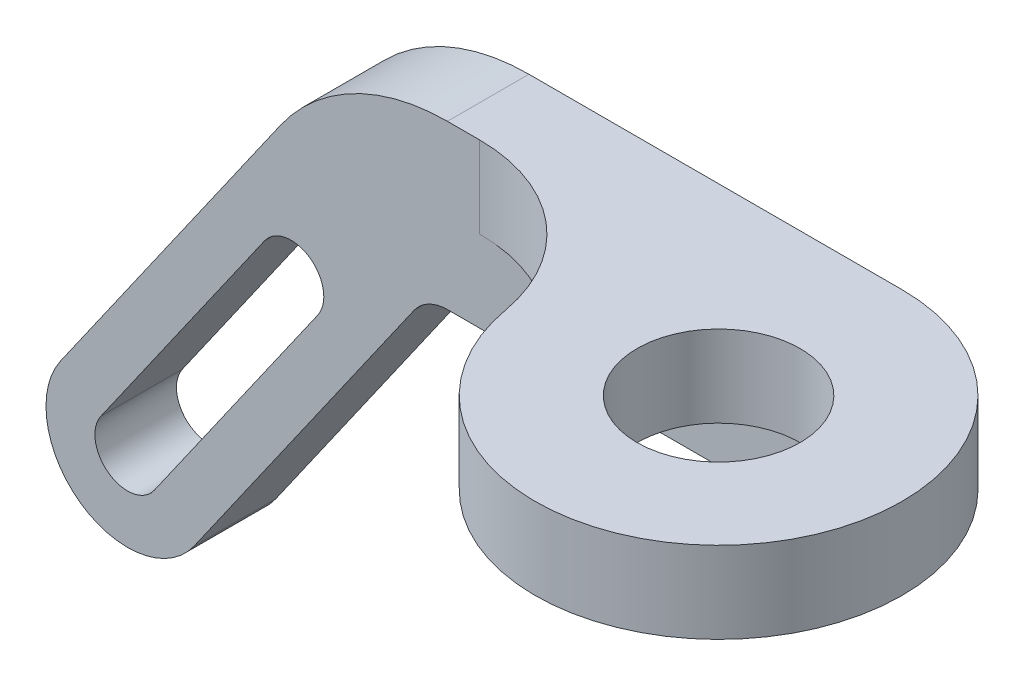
ISO-10303-21;
HEADER;
FILE_DESCRIPTION(('STEP AP214'),'2;1');
FILE_NAME('part.step','',(''),(''),'','','');
FILE_SCHEMA(('AUTOMOTIVE_DESIGN { 1 0 10303 214 1 1 1 1 }'));
ENDSEC;
DATA;
#1=APPLICATION_CONTEXT('core data for automotive mechanical design processes');
#2=APPLICATION_PROTOCOL_DEFINITION('international standard','automotive_design',2000,#1);
#3=PRODUCT_CONTEXT('',#1,'mechanical');
#4=PRODUCT('Part','Part','',(#3));
#5=PRODUCT_RELATED_PRODUCT_CATEGORY('part','',(#4));
#6=PRODUCT_DEFINITION_FORMATION('','',#4);
#7=PRODUCT_DEFINITION_CONTEXT('part definition',#1,'design');
#8=PRODUCT_DEFINITION('design','',#6,#7);
#9=PRODUCT_DEFINITION_SHAPE('','',#8);
#10=(LENGTH_UNIT() NAMED_UNIT(*) SI_UNIT(.MILLI.,.METRE.));
#11=(NAMED_UNIT(*) PLANE_ANGLE_UNIT() SI_UNIT($,.RADIAN.));
#12=(NAMED_UNIT(*) SI_UNIT($,.STERADIAN.) SOLID_ANGLE_UNIT());
#13=UNCERTAINTY_MEASURE_WITH_UNIT(LENGTH_MEASURE(1.E-05),#10,'distance_accuracy_value','');
#14=(GEOMETRIC_REPRESENTATION_CONTEXT(3) GLOBAL_UNCERTAINTY_ASSIGNED_CONTEXT((#13)) GLOBAL_UNIT_ASSIGNED_CONTEXT((#10,
#11,#12)) REPRESENTATION_CONTEXT('',''));
#15=CARTESIAN_POINT('',(0.,0.,0.));
#16=DIRECTION('',(0.,0.,1.));
#17=DIRECTION('',(1.,0.,0.));
#18=AXIS2_PLACEMENT_3D('',#15,#16,#17);
#19=CARTESIAN_POINT('',(45.7627579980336,25.,10.));
#20=DIRECTION('',(-1.,0.,0.));
#21=DIRECTION('',(0.,0.,1.));
#22=AXIS2_PLACEMENT_3D('',#19,#20,#21);
#23=PLANE('',#22);
#24=DIRECTION('',(0.,0.,-1.));
#25=VECTOR('',#24,1.);
#26=CARTESIAN_POINT('',(45.7627579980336,15.,10.));
#27=LINE('',#26,#25);
#28=CARTESIAN_POINT('',(45.7627579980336,15.,10.));
#29=VERTEX_POINT('',#28);
#30=CARTESIAN_POINT('',(45.7627579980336,15.,0.));
#31=VERTEX_POINT('',#30);
#32=EDGE_CURVE('E180',#29,#31,#27,.T.);
#33=ORIENTED_EDGE('',*,*,#32,.F.);
#34=DIRECTION('',(0.,1.,0.));
#35=VECTOR('',#34,1.);
#36=CARTESIAN_POINT('',(45.7627579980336,25.,10.));
#37=LINE('',#36,#35);
#38=CARTESIAN_POINT('',(45.7627579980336,5.,10.));
#39=VERTEX_POINT('',#38);
#40=EDGE_CURVE('E194',#39,#29,#37,.T.);
#41=ORIENTED_EDGE('',*,*,#40,.F.);
#42=DIRECTION('',(0.,0.,-1.));
#43=VECTOR('',#42,1.);
#44=CARTESIAN_POINT('',(45.7627579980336,5.,10.));
#45=LINE('',#44,#43);
#46=CARTESIAN_POINT('',(45.7627579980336,5.,0.));
#47=VERTEX_POINT('',#46);
#48=EDGE_CURVE('E229',#39,#47,#45,.T.);
#49=ORIENTED_EDGE('',*,*,#48,.T.);
#50=DIRECTION('',(0.,1.,0.));
#51=VECTOR('',#50,1.);
#52=CARTESIAN_POINT('',(45.7627579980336,25.,0.));
#53=LINE('',#52,#51);
#54=EDGE_CURVE('E213',#47,#31,#53,.T.);
#55=ORIENTED_EDGE('',*,*,#54,.T.);
#56=EDGE_LOOP('',(#33,#41,#49,#55));
#57=FACE_BOUND('',#56,.T.);
#58=ADVANCED_FACE('F32',(#57),#23,.F.);
#59=CARTESIAN_POINT('',(-39.2372420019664,-29.88488702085,10.));
#60=DIRECTION('',(0.,0.,-1.));
#61=DIRECTION('',(-1.,0.,0.));
#62=AXIS2_PLACEMENT_3D('',#59,#60,#61);
#63=CYLINDRICAL_SURFACE('',#62,10.);
#64=CARTESIAN_POINT('',(-39.2372420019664,-29.88488702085,0.));
#65=DIRECTION('',(0.,0.,1.));
#66=DIRECTION('',(1.,0.,0.));
#67=AXIS2_PLACEMENT_3D('',#64,#65,#66);
#68=CIRCLE('',#67,10.);
#69=CARTESIAN_POINT('',(-47.4287624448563,-24.1491226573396,0.));
#70=VERTEX_POINT('',#69);
#71=CARTESIAN_POINT('',(-31.0457215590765,-35.6206513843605,0.));
#72=VERTEX_POINT('',#71);
#73=EDGE_CURVE('E183',#70,#72,#68,.T.);
#74=ORIENTED_EDGE('',*,*,#73,.T.);
#75=DIRECTION('',(0.,0.,-1.));
#76=VECTOR('',#75,1.);
#77=CARTESIAN_POINT('',(-31.0457215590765,-35.6206513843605,10.));
#78=LINE('',#77,#76);
#79=CARTESIAN_POINT('',(-31.0457215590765,-35.6206513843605,10.));
#80=VERTEX_POINT('',#79);
#81=EDGE_CURVE('E238',#80,#72,#78,.T.);
#82=ORIENTED_EDGE('',*,*,#81,.F.);
#83=CARTESIAN_POINT('',(-39.2372420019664,-29.88488702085,10.));
#84=DIRECTION('',(0.,0.,1.));
#85=DIRECTION('',(1.,0.,0.));
#86=AXIS2_PLACEMENT_3D('',#83,#84,#85);
#87=CIRCLE('',#86,10.);
#88=CARTESIAN_POINT('',(-47.4287624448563,-24.1491226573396,10.));
#89=VERTEX_POINT('',#88);
#90=EDGE_CURVE('E184',#89,#80,#87,.T.);
#91=ORIENTED_EDGE('',*,*,#90,.F.);
#92=DIRECTION('',(0.,0.,-1.));
#93=VECTOR('',#92,1.);
#94=CARTESIAN_POINT('',(-47.4287624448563,-24.1491226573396,10.));
#95=LINE('',#94,#93);
#96=EDGE_CURVE('E203',#89,#70,#95,.T.);
#97=ORIENTED_EDGE('',*,*,#96,.T.);
#98=EDGE_LOOP('',(#74,#82,#91,#97));
#99=FACE_BOUND('',#98,.T.);
#100=ADVANCED_FACE('F277',(#99),#63,.T.);
#101=CARTESIAN_POINT('',(-31.0457215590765,-35.6206513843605,10.));
#102=DIRECTION('',(-0.819152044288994,0.573576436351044,0.));
#103=DIRECTION('',(-0.573576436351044,-0.819152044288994,0.));
#104=AXIS2_PLACEMENT_3D('',#101,#102,#103);
#105=PLANE('',#104);
#106=DIRECTION('',(0.573576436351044,0.819152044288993,0.));
#107=VECTOR('',#106,1.);
#108=CARTESIAN_POINT('',(-31.0457215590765,-35.6206513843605,0.));
#109=LINE('',#108,#107);
#110=CARTESIAN_POINT('',(-4.09576022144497,2.86788218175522,0.));
#111=VERTEX_POINT('',#110);
#112=EDGE_CURVE('E206',#72,#111,#109,.T.);
#113=ORIENTED_EDGE('',*,*,#112,.T.);
#114=DIRECTION('',(0.,0.,-1.));
#115=VECTOR('',#114,1.);
#116=CARTESIAN_POINT('',(-4.09576022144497,2.86788218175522,10.));
#117=LINE('',#116,#115);
#118=CARTESIAN_POINT('',(-4.09576022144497,2.86788218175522,10.));
#119=VERTEX_POINT('',#118);
#120=EDGE_CURVE('E235',#119,#111,#117,.T.);
#121=ORIENTED_EDGE('',*,*,#120,.F.);
#122=DIRECTION('',(0.573576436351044,0.819152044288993,0.));
#123=VECTOR('',#122,1.);
#124=CARTESIAN_POINT('',(-31.0457215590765,-35.6206513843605,10.));
#125=LINE('',#124,#123);
#126=EDGE_CURVE('E187',#80,#119,#125,.T.);
#127=ORIENTED_EDGE('',*,*,#126,.F.);
#128=ORIENTED_EDGE('',*,*,#81,.T.);
#129=EDGE_LOOP('',(#113,#121,#127,#128));
#130=FACE_BOUND('',#129,.T.);
#131=ADVANCED_FACE('F279',(#130),#105,.F.);
#132=CARTESIAN_POINT('',(0.,0.,10.));
#133=DIRECTION('',(0.,0.,-1.));
#134=DIRECTION('',(-1.,0.,0.));
#135=AXIS2_PLACEMENT_3D('',#132,#133,#134);
#136=CYLINDRICAL_SURFACE('',#135,5.);
#137=CARTESIAN_POINT('',(0.,0.,0.));
#138=DIRECTION('',(0.,0.,-1.));
#139=DIRECTION('',(-1.,0.,0.));
#140=AXIS2_PLACEMENT_3D('',#137,#138,#139);
#141=CIRCLE('',#140,5.);
#142=CARTESIAN_POINT('',(0.,5.,0.));
#143=VERTEX_POINT('',#142);
#144=EDGE_CURVE('E208',#111,#143,#141,.T.);
#145=ORIENTED_EDGE('',*,*,#144,.T.);
#146=DIRECTION('',(0.,0.,-1.));
#147=VECTOR('',#146,1.);
#148=CARTESIAN_POINT('',(0.,5.,10.));
#149=LINE('',#148,#147);
#150=CARTESIAN_POINT('',(0.,5.,10.));
#151=VERTEX_POINT('',#150);
#152=EDGE_CURVE('E232',#151,#143,#149,.T.);
#153=ORIENTED_EDGE('',*,*,#152,.F.);
#154=CARTESIAN_POINT('',(0.,0.,10.));
#155=DIRECTION('',(0.,0.,-1.));
#156=DIRECTION('',(-1.,0.,0.));
#157=AXIS2_PLACEMENT_3D('',#154,#155,#156);
#158=CIRCLE('',#157,5.);
#159=EDGE_CURVE('E190',#119,#151,#158,.T.);
#160=ORIENTED_EDGE('',*,*,#159,.F.);
#161=ORIENTED_EDGE('',*,*,#120,.T.);
#162=EDGE_LOOP('',(#145,#153,#160,#161));
#163=FACE_BOUND('',#162,.T.);
#164=ADVANCED_FACE('F286',(#163),#136,.F.);
#165=CARTESIAN_POINT('',(0.,5.,10.));
#166=DIRECTION('',(0.,1.,0.));
#167=DIRECTION('',(0.,0.,1.));
#168=AXIS2_PLACEMENT_3D('',#165,#166,#167);
#169=PLANE('',#168);
#170=DIRECTION('',(1.,0.,0.));
#171=VECTOR('',#170,1.);
#172=CARTESIAN_POINT('',(0.,5.,0.));
#173=LINE('',#172,#171);
#174=EDGE_CURVE('E210',#143,#47,#173,.T.);
#175=ORIENTED_EDGE('',*,*,#174,.T.);
#176=ORIENTED_EDGE('',*,*,#48,.F.);
#177=DIRECTION('',(1.,0.,0.));
#178=VECTOR('',#177,1.);
#179=CARTESIAN_POINT('',(0.,5.,10.));
#180=LINE('',#179,#178);
#181=EDGE_CURVE('E192',#151,#39,#180,.T.);
#182=ORIENTED_EDGE('',*,*,#181,.F.);
#183=ORIENTED_EDGE('',*,*,#152,.T.);
#184=EDGE_LOOP('',(#175,#176,#182,#183));
#185=FACE_BOUND('',#184,.T.);
#186=ADVANCED_FACE('F290',(#185),#169,.F.);
#187=CARTESIAN_POINT('',(0.,25.,10.));
#188=DIRECTION('',(0.,-1.,0.));
#189=DIRECTION('',(0.,0.,-1.));
#190=AXIS2_PLACEMENT_3D('',#187,#188,#189);
#191=PLANE('',#190);
#192=CARTESIAN_POINT('',(45.7627579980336,25.,22.5));
#193=DIRECTION('',(0.,1.,0.));
#194=DIRECTION('',(0.,0.,1.));
#195=AXIS2_PLACEMENT_3D('',#192,#193,#194);
#196=CIRCLE('',#195,9.99999999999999);
#197=CARTESIAN_POINT('',(45.7627579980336,25.,32.5));
#198=VERTEX_POINT('',#197);
#199=EDGE_CURVE('E160',#198,#198,#196,.T.);
#200=ORIENTED_EDGE('',*,*,#199,.F.);
#201=EDGE_LOOP('',(#200));
#202=FACE_BOUND('',#201,.T.);
#203=DIRECTION('',(-1.,0.,0.));
#204=VECTOR('',#203,1.);
#205=CARTESIAN_POINT('',(0.,25.,10.));
#206=LINE('',#205,#204);
#207=CARTESIAN_POINT('',(3.9297566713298,25.,10.));
#208=VERTEX_POINT('',#207);
#209=CARTESIAN_POINT('',(0.,25.,10.));
#210=VERTEX_POINT('',#209);
#211=EDGE_CURVE('E197',#208,#210,#206,.T.);
#212=ORIENTED_EDGE('',*,*,#211,.F.);
#213=CARTESIAN_POINT('',(3.9297566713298,25.,30.));
#214=DIRECTION('',(0.,-1.,0.));
#215=DIRECTION('',(0.,0.,-1.));
#216=AXIS2_PLACEMENT_3D('',#213,#214,#215);
#217=CIRCLE('',#216,20.);
#218=CARTESIAN_POINT('',(23.6158749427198,25.,26.4705882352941));
#219=VERTEX_POINT('',#218);
#220=EDGE_CURVE('E11',#208,#219,#217,.T.);
#221=ORIENTED_EDGE('',*,*,#220,.T.);
#222=CARTESIAN_POINT('',(45.7627579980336,25.,22.5));
#223=DIRECTION('',(0.,1.,0.));
#224=DIRECTION('',(0.,0.,1.));
#225=AXIS2_PLACEMENT_3D('',#222,#223,#224);
#226=CIRCLE('',#225,22.5);
#227=CARTESIAN_POINT('',(45.7627579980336,25.,0.));
#228=VERTEX_POINT('',#227);
#229=EDGE_CURVE('E171',#219,#228,#226,.T.);
#230=ORIENTED_EDGE('',*,*,#229,.T.);
#231=DIRECTION('',(-1.,0.,0.));
#232=VECTOR('',#231,1.);
#233=CARTESIAN_POINT('',(0.,25.,0.));
#234=LINE('',#233,#232);
#235=CARTESIAN_POINT('',(0.,25.,0.));
#236=VERTEX_POINT('',#235);
#237=EDGE_CURVE('E216',#228,#236,#234,.T.);
#238=ORIENTED_EDGE('',*,*,#237,.T.);
#239=DIRECTION('',(0.,0.,-1.));
#240=VECTOR('',#239,1.);
#241=CARTESIAN_POINT('',(0.,25.,10.));
#242=LINE('',#241,#240);
#243=EDGE_CURVE('E226',#210,#236,#242,.T.);
#244=ORIENTED_EDGE('',*,*,#243,.F.);
#245=EDGE_LOOP('',(#212,#221,#230,#238,#244));
#246=FACE_BOUND('',#245,.T.);
#247=ADVANCED_FACE('F260',(#202,#246),#191,.F.);
#248=CARTESIAN_POINT('',(0.,0.,10.));
#249=DIRECTION('',(0.,0.,-1.));
#250=DIRECTION('',(-1.,0.,0.));
#251=AXIS2_PLACEMENT_3D('',#248,#249,#250);
#252=CYLINDRICAL_SURFACE('',#251,25.);
#253=CARTESIAN_POINT('',(0.,0.,0.));
#254=DIRECTION('',(0.,0.,1.));
#255=DIRECTION('',(-1.,0.,0.));
#256=AXIS2_PLACEMENT_3D('',#253,#254,#255);
#257=CIRCLE('',#256,25.);
#258=CARTESIAN_POINT('',(-20.4788011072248,14.3394109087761,0.));
#259=VERTEX_POINT('',#258);
#260=EDGE_CURVE('E218',#236,#259,#257,.T.);
#261=ORIENTED_EDGE('',*,*,#260,.T.);
#262=DIRECTION('',(0.,0.,-1.));
#263=VECTOR('',#262,1.);
#264=CARTESIAN_POINT('',(-20.4788011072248,14.3394109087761,10.));
#265=LINE('',#264,#263);
#266=CARTESIAN_POINT('',(-20.4788011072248,14.3394109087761,10.));
#267=VERTEX_POINT('',#266);
#268=EDGE_CURVE('E223',#267,#259,#265,.T.);
#269=ORIENTED_EDGE('',*,*,#268,.F.);
#270=CARTESIAN_POINT('',(0.,0.,10.));
#271=DIRECTION('',(0.,0.,1.));
#272=DIRECTION('',(-1.,0.,0.));
#273=AXIS2_PLACEMENT_3D('',#270,#271,#272);
#274=CIRCLE('',#273,25.);
#275=EDGE_CURVE('E199',#210,#267,#274,.T.);
#276=ORIENTED_EDGE('',*,*,#275,.F.);
#277=ORIENTED_EDGE('',*,*,#243,.T.);
#278=EDGE_LOOP('',(#261,#269,#276,#277));
#279=FACE_BOUND('',#278,.T.);
#280=ADVANCED_FACE('F267',(#279),#252,.T.);
#281=CARTESIAN_POINT('',(-47.4287624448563,-24.1491226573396,10.));
#282=DIRECTION('',(0.819152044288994,-0.573576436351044,0.));
#283=DIRECTION('',(0.573576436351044,0.819152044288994,0.));
#284=AXIS2_PLACEMENT_3D('',#281,#282,#283);
#285=PLANE('',#284);
#286=DIRECTION('',(-0.573576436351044,-0.819152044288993,0.));
#287=VECTOR('',#286,1.);
#288=CARTESIAN_POINT('',(-47.4287624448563,-24.1491226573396,0.));
#289=LINE('',#288,#287);
#290=EDGE_CURVE('E188',#259,#70,#289,.T.);
#291=ORIENTED_EDGE('',*,*,#290,.T.);
#292=ORIENTED_EDGE('',*,*,#96,.F.);
#293=DIRECTION('',(-0.573576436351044,-0.819152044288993,0.));
#294=VECTOR('',#293,1.);
#295=CARTESIAN_POINT('',(-47.4287624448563,-24.1491226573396,10.));
#296=LINE('',#295,#294);
#297=EDGE_CURVE('E201',#267,#89,#296,.T.);
#298=ORIENTED_EDGE('',*,*,#297,.F.);
#299=ORIENTED_EDGE('',*,*,#268,.T.);
#300=EDGE_LOOP('',(#291,#292,#298,#299));
#301=FACE_BOUND('',#300,.T.);
#302=ADVANCED_FACE('F273',(#301),#285,.F.);
#303=CARTESIAN_POINT('',(-39.2372420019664,-29.88488702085,10.));
#304=DIRECTION('',(0.,0.,1.));
#305=DIRECTION('',(1.,0.,0.));
#306=AXIS2_PLACEMENT_3D('',#303,#304,#305);
#307=PLANE('',#306);
#308=CARTESIAN_POINT('',(-39.2372420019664,-29.88488702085,10.));
#309=DIRECTION('',(0.,0.,1.));
#310=DIRECTION('',(1.,0.,0.));
#311=AXIS2_PLACEMENT_3D('',#308,#309,#310);
#312=CIRCLE('',#311,3.99999999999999);
#313=CARTESIAN_POINT('',(-42.5138501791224,-27.5905812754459,10.));
#314=VERTEX_POINT('',#313);
#315=CARTESIAN_POINT('',(-35.9606338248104,-32.1791927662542,10.));
#316=VERTEX_POINT('',#315);
#317=EDGE_CURVE('E48',#314,#316,#312,.T.);
#318=ORIENTED_EDGE('',*,*,#317,.F.);
#319=DIRECTION('',(-0.573576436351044,-0.819152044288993,0.));
#320=VECTOR('',#319,1.);
#321=CARTESIAN_POINT('',(-42.5138501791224,-27.5905812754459,10.));
#322=LINE('',#321,#320);
#323=CARTESIAN_POINT('',(-22.4386749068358,1.0797402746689,10.));
#324=VERTEX_POINT('',#323);
#325=EDGE_CURVE('E154',#324,#314,#322,.T.);
#326=ORIENTED_EDGE('',*,*,#325,.F.);
#327=CARTESIAN_POINT('',(-19.1620667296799,-1.21456547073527,10.));
#328=DIRECTION('',(0.,0.,1.));
#329=DIRECTION('',(1.,0.,0.));
#330=AXIS2_PLACEMENT_3D('',#327,#328,#329);
#331=CIRCLE('',#330,4.);
#332=CARTESIAN_POINT('',(-15.8854585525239,-3.50887121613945,10.));
#333=VERTEX_POINT('',#332);
#334=EDGE_CURVE('E157',#333,#324,#331,.T.);
#335=ORIENTED_EDGE('',*,*,#334,.F.);
#336=DIRECTION('',(0.573576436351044,0.819152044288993,0.));
#337=VECTOR('',#336,1.);
#338=CARTESIAN_POINT('',(-35.9606338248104,-32.1791927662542,10.));
#339=LINE('',#338,#337);
#340=EDGE_CURVE('E165',#316,#333,#339,.T.);
#341=ORIENTED_EDGE('',*,*,#340,.F.);
#342=EDGE_LOOP('',(#318,#326,#335,#341));
#343=FACE_BOUND('',#342,.T.);
#344=DIRECTION('',(-1.,0.,0.));
#345=VECTOR('',#344,1.);
#346=CARTESIAN_POINT('',(-39.2372420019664,15.,10.));
#347=LINE('',#346,#345);
#348=CARTESIAN_POINT('',(3.9297566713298,15.,10.));
#349=VERTEX_POINT('',#348);
#350=EDGE_CURVE('E177',#29,#349,#347,.T.);
#351=ORIENTED_EDGE('',*,*,#350,.T.);
#352=DIRECTION('',(0.,-1.,0.));
#353=VECTOR('',#352,1.);
#354=CARTESIAN_POINT('',(3.9297566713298,25.,10.));
#355=LINE('',#354,#353);
#356=EDGE_CURVE('E244',#349,#208,#355,.F.);
#357=ORIENTED_EDGE('',*,*,#356,.T.);
#358=ORIENTED_EDGE('',*,*,#211,.T.);
#359=ORIENTED_EDGE('',*,*,#275,.T.);
#360=ORIENTED_EDGE('',*,*,#297,.T.);
#361=ORIENTED_EDGE('',*,*,#90,.T.);
#362=ORIENTED_EDGE('',*,*,#126,.T.);
#363=ORIENTED_EDGE('',*,*,#159,.T.);
#364=ORIENTED_EDGE('',*,*,#181,.T.);
#365=ORIENTED_EDGE('',*,*,#40,.T.);
#366=EDGE_LOOP('',(#351,#357,#358,#359,#360,#361,#362,#363,#364,#365));
#367=FACE_BOUND('',#366,.T.);
#368=ADVANCED_FACE('F257',(#343,#367),#307,.T.);
#369=CARTESIAN_POINT('',(-39.2372420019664,-29.88488702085,0.));
#370=DIRECTION('',(0.,0.,1.));
#371=DIRECTION('',(1.,0.,0.));
#372=AXIS2_PLACEMENT_3D('',#369,#370,#371);
#373=PLANE('',#372);
#374=DIRECTION('',(-0.573576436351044,-0.819152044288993,0.));
#375=VECTOR('',#374,1.);
#376=CARTESIAN_POINT('',(-42.5138501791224,-27.5905812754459,0.));
#377=LINE('',#376,#375);
#378=CARTESIAN_POINT('',(-22.4386749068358,1.0797402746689,0.));
#379=VERTEX_POINT('',#378);
#380=CARTESIAN_POINT('',(-42.5138501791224,-27.5905812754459,0.));
#381=VERTEX_POINT('',#380);
#382=EDGE_CURVE('E144',#379,#381,#377,.T.);
#383=ORIENTED_EDGE('',*,*,#382,.T.);
#384=CARTESIAN_POINT('',(-39.2372420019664,-29.88488702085,0.));
#385=DIRECTION('',(0.,0.,1.));
#386=DIRECTION('',(1.,0.,0.));
#387=AXIS2_PLACEMENT_3D('',#384,#385,#386);
#388=CIRCLE('',#387,3.99999999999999);
#389=CARTESIAN_POINT('',(-35.9606338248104,-32.1791927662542,0.));
#390=VERTEX_POINT('',#389);
#391=EDGE_CURVE('E138',#381,#390,#388,.T.);
#392=ORIENTED_EDGE('',*,*,#391,.T.);
#393=DIRECTION('',(0.573576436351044,0.819152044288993,0.));
#394=VECTOR('',#393,1.);
#395=CARTESIAN_POINT('',(-35.9606338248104,-32.1791927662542,0.));
#396=LINE('',#395,#394);
#397=CARTESIAN_POINT('',(-15.8854585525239,-3.50887121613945,0.));
#398=VERTEX_POINT('',#397);
#399=EDGE_CURVE('E147',#390,#398,#396,.T.);
#400=ORIENTED_EDGE('',*,*,#399,.T.);
#401=CARTESIAN_POINT('',(-19.1620667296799,-1.21456547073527,0.));
#402=DIRECTION('',(0.,0.,1.));
#403=DIRECTION('',(1.,0.,0.));
#404=AXIS2_PLACEMENT_3D('',#401,#402,#403);
#405=CIRCLE('',#404,4.);
#406=EDGE_CURVE('E56',#398,#379,#405,.T.);
#407=ORIENTED_EDGE('',*,*,#406,.T.);
#408=EDGE_LOOP('',(#383,#392,#400,#407));
#409=FACE_BOUND('',#408,.T.);
#410=ORIENTED_EDGE('',*,*,#73,.F.);
#411=ORIENTED_EDGE('',*,*,#290,.F.);
#412=ORIENTED_EDGE('',*,*,#260,.F.);
#413=ORIENTED_EDGE('',*,*,#237,.F.);
#414=EDGE_CURVE('E212',#31,#228,#53,.T.);
#415=ORIENTED_EDGE('',*,*,#414,.F.);
#416=ORIENTED_EDGE('',*,*,#54,.F.);
#417=ORIENTED_EDGE('',*,*,#174,.F.);
#418=ORIENTED_EDGE('',*,*,#144,.F.);
#419=ORIENTED_EDGE('',*,*,#112,.F.);
#420=EDGE_LOOP('',(#410,#411,#412,#413,#415,#416,#417,#418,#419));
#421=FACE_BOUND('',#420,.T.);
#422=ADVANCED_FACE('F151',(#409,#421),#373,.F.);
#423=CARTESIAN_POINT('',(45.7627579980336,15.,22.5));
#424=DIRECTION('',(0.,1.,0.));
#425=DIRECTION('',(0.,0.,1.));
#426=AXIS2_PLACEMENT_3D('',#423,#424,#425);
#427=PLANE('',#426);
#428=CARTESIAN_POINT('',(45.7627579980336,15.,22.5));
#429=DIRECTION('',(0.,1.,0.));
#430=DIRECTION('',(0.,0.,1.));
#431=AXIS2_PLACEMENT_3D('',#428,#429,#430);
#432=CIRCLE('',#431,9.99999999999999);
#433=CARTESIAN_POINT('',(45.7627579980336,15.,32.5));
#434=VERTEX_POINT('',#433);
#435=EDGE_CURVE('E36',#434,#434,#432,.T.);
#436=ORIENTED_EDGE('',*,*,#435,.T.);
#437=EDGE_LOOP('',(#436));
#438=FACE_BOUND('',#437,.T.);
#439=ORIENTED_EDGE('',*,*,#350,.F.);
#440=ORIENTED_EDGE('',*,*,#32,.T.);
#441=CARTESIAN_POINT('',(45.7627579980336,15.,22.5));
#442=DIRECTION('',(0.,1.,0.));
#443=DIRECTION('',(0.,0.,1.));
#444=AXIS2_PLACEMENT_3D('',#441,#442,#443);
#445=CIRCLE('',#444,22.5);
#446=CARTESIAN_POINT('',(23.6158749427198,15.,26.4705882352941));
#447=VERTEX_POINT('',#446);
#448=EDGE_CURVE('E175',#447,#31,#445,.T.);
#449=ORIENTED_EDGE('',*,*,#448,.F.);
#450=CARTESIAN_POINT('',(3.9297566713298,15.,30.));
#451=DIRECTION('',(0.,1.,0.));
#452=DIRECTION('',(0.,0.,1.));
#453=AXIS2_PLACEMENT_3D('',#450,#451,#452);
#454=CIRCLE('',#453,20.);
#455=EDGE_CURVE('E41',#447,#349,#454,.T.);
#456=ORIENTED_EDGE('',*,*,#455,.T.);
#457=EDGE_LOOP('',(#439,#440,#449,#456));
#458=FACE_BOUND('',#457,.T.);
#459=ADVANCED_FACE('F251',(#438,#458),#427,.F.);
#460=CARTESIAN_POINT('',(45.7627579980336,15.,22.5));
#461=DIRECTION('',(0.,1.,0.));
#462=DIRECTION('',(0.,0.,1.));
#463=AXIS2_PLACEMENT_3D('',#460,#461,#462);
#464=CYLINDRICAL_SURFACE('',#463,22.5);
#465=ORIENTED_EDGE('',*,*,#229,.F.);
#466=DIRECTION('',(0.,1.,0.));
#467=VECTOR('',#466,1.);
#468=CARTESIAN_POINT('',(23.6158749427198,15.,26.4705882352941));
#469=LINE('',#468,#467);
#470=EDGE_CURVE('E241',#219,#447,#469,.F.);
#471=ORIENTED_EDGE('',*,*,#470,.T.);
#472=ORIENTED_EDGE('',*,*,#448,.T.);
#473=ORIENTED_EDGE('',*,*,#414,.T.);
#474=EDGE_LOOP('',(#465,#471,#472,#473));
#475=FACE_BOUND('',#474,.T.);
#476=ADVANCED_FACE('F297',(#475),#464,.T.);
#477=CARTESIAN_POINT('',(3.9297566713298,15.,30.));
#478=DIRECTION('',(0.,1.,0.));
#479=DIRECTION('',(0.,0.,1.));
#480=AXIS2_PLACEMENT_3D('',#477,#478,#479);
#481=CYLINDRICAL_SURFACE('',#480,20.);
#482=ORIENTED_EDGE('',*,*,#220,.F.);
#483=ORIENTED_EDGE('',*,*,#356,.F.);
#484=ORIENTED_EDGE('',*,*,#455,.F.);
#485=ORIENTED_EDGE('',*,*,#470,.F.);
#486=EDGE_LOOP('',(#482,#483,#484,#485));
#487=FACE_BOUND('',#486,.T.);
#488=ADVANCED_FACE('F34',(#487),#481,.F.);
#489=CARTESIAN_POINT('',(-39.2372420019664,-29.88488702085,0.));
#490=DIRECTION('',(0.,0.,1.));
#491=DIRECTION('',(1.,0.,0.));
#492=AXIS2_PLACEMENT_3D('',#489,#490,#491);
#493=CYLINDRICAL_SURFACE('',#492,3.99999999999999);
#494=ORIENTED_EDGE('',*,*,#317,.T.);
#495=DIRECTION('',(0.,0.,1.));
#496=VECTOR('',#495,1.);
#497=CARTESIAN_POINT('',(-35.9606338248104,-32.1791927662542,0.));
#498=LINE('',#497,#496);
#499=EDGE_CURVE('E134',#390,#316,#498,.T.);
#500=ORIENTED_EDGE('',*,*,#499,.F.);
#501=ORIENTED_EDGE('',*,*,#391,.F.);
#502=DIRECTION('',(0.,0.,1.));
#503=VECTOR('',#502,1.);
#504=CARTESIAN_POINT('',(-42.5138501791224,-27.5905812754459,0.));
#505=LINE('',#504,#503);
#506=EDGE_CURVE('E169',#381,#314,#505,.T.);
#507=ORIENTED_EDGE('',*,*,#506,.T.);
#508=EDGE_LOOP('',(#494,#500,#501,#507));
#509=FACE_BOUND('',#508,.T.);
#510=ADVANCED_FACE('F136',(#509),#493,.F.);
#511=CARTESIAN_POINT('',(-42.5138501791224,-27.5905812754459,0.));
#512=DIRECTION('',(-0.819152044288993,0.573576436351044,0.));
#513=DIRECTION('',(-0.573576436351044,-0.819152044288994,0.));
#514=AXIS2_PLACEMENT_3D('',#511,#512,#513);
#515=PLANE('',#514);
#516=ORIENTED_EDGE('',*,*,#325,.T.);
#517=ORIENTED_EDGE('',*,*,#506,.F.);
#518=ORIENTED_EDGE('',*,*,#382,.F.);
#519=DIRECTION('',(0.,0.,1.));
#520=VECTOR('',#519,1.);
#521=CARTESIAN_POINT('',(-22.4386749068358,1.0797402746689,0.));
#522=LINE('',#521,#520);
#523=EDGE_CURVE('E172',#379,#324,#522,.T.);
#524=ORIENTED_EDGE('',*,*,#523,.T.);
#525=EDGE_LOOP('',(#516,#517,#518,#524));
#526=FACE_BOUND('',#525,.T.);
#527=ADVANCED_FACE('F393',(#526),#515,.F.);
#528=CARTESIAN_POINT('',(-19.1620667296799,-1.21456547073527,0.));
#529=DIRECTION('',(0.,0.,1.));
#530=DIRECTION('',(1.,0.,0.));
#531=AXIS2_PLACEMENT_3D('',#528,#529,#530);
#532=CYLINDRICAL_SURFACE('',#531,4.);
#533=ORIENTED_EDGE('',*,*,#334,.T.);
#534=ORIENTED_EDGE('',*,*,#523,.F.);
#535=ORIENTED_EDGE('',*,*,#406,.F.);
#536=DIRECTION('',(0.,0.,1.));
#537=VECTOR('',#536,1.);
#538=CARTESIAN_POINT('',(-15.8854585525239,-3.50887121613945,0.));
#539=LINE('',#538,#537);
#540=EDGE_CURVE('E143',#398,#333,#539,.T.);
#541=ORIENTED_EDGE('',*,*,#540,.T.);
#542=EDGE_LOOP('',(#533,#534,#535,#541));
#543=FACE_BOUND('',#542,.T.);
#544=ADVANCED_FACE('F387',(#543),#532,.F.);
#545=CARTESIAN_POINT('',(-35.9606338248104,-32.1791927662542,0.));
#546=DIRECTION('',(0.819152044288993,-0.573576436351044,0.));
#547=DIRECTION('',(0.573576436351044,0.819152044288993,0.));
#548=AXIS2_PLACEMENT_3D('',#545,#546,#547);
#549=PLANE('',#548);
#550=ORIENTED_EDGE('',*,*,#340,.T.);
#551=ORIENTED_EDGE('',*,*,#540,.F.);
#552=ORIENTED_EDGE('',*,*,#399,.F.);
#553=ORIENTED_EDGE('',*,*,#499,.T.);
#554=EDGE_LOOP('',(#550,#551,#552,#553));
#555=FACE_BOUND('',#554,.T.);
#556=ADVANCED_FACE('F148',(#555),#549,.F.);
#557=CARTESIAN_POINT('',(45.7627579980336,25.,22.5));
#558=DIRECTION('',(0.,1.,0.));
#559=DIRECTION('',(0.,0.,1.));
#560=AXIS2_PLACEMENT_3D('',#557,#558,#559);
#561=CYLINDRICAL_SURFACE('',#560,9.99999999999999);
#562=ORIENTED_EDGE('',*,*,#199,.T.);
#563=EDGE_LOOP('',(#562));
#564=FACE_BOUND('',#563,.T.);
#565=ORIENTED_EDGE('',*,*,#435,.F.);
#566=EDGE_LOOP('',(#565));
#567=FACE_BOUND('',#566,.T.);
#568=ADVANCED_FACE('F374',(#564,#567),#561,.F.);
#569=CLOSED_SHELL('',(#58,#100,#131,#164,#186,#247,#280,#302,#368,#422,#459,#476,#488,#510,#527,
#544,#556,#568));
#570=MANIFOLD_SOLID_BREP('B2',#569);
#571=ADVANCED_BREP_SHAPE_REPRESENTATION('',(#18,#570),#14);
#572=SHAPE_DEFINITION_REPRESENTATION(#9,#571);
ENDSEC;
END-ISO-10303-21;
